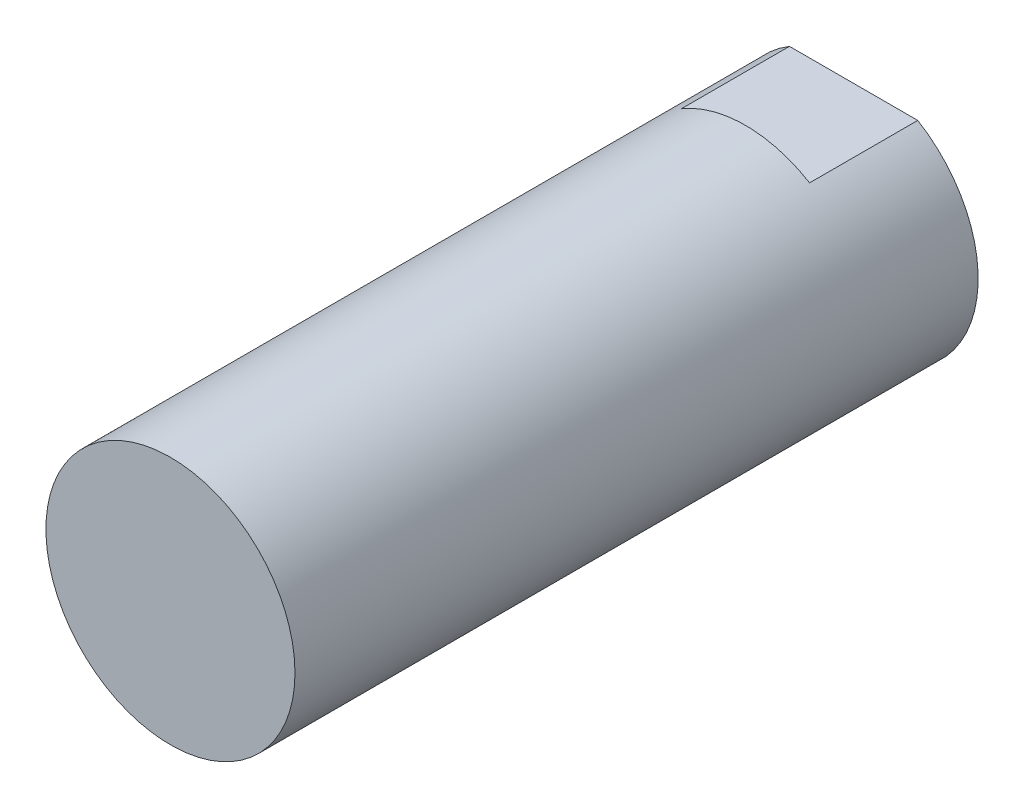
ISO-10303-21;
HEADER;
FILE_DESCRIPTION(('STEP AP214'),'2;1');
FILE_NAME('part.step','',(''),(''),'','','');
FILE_SCHEMA(('AUTOMOTIVE_DESIGN { 1 0 10303 214 1 1 1 1 }'));
ENDSEC;
DATA;
#1=APPLICATION_CONTEXT('core data for automotive mechanical design processes');
#2=APPLICATION_PROTOCOL_DEFINITION('international standard','automotive_design',2000,#1);
#3=PRODUCT_CONTEXT('',#1,'mechanical');
#4=PRODUCT('Part','Part','',(#3));
#5=PRODUCT_RELATED_PRODUCT_CATEGORY('part','',(#4));
#6=PRODUCT_DEFINITION_FORMATION('','',#4);
#7=PRODUCT_DEFINITION_CONTEXT('part definition',#1,'design');
#8=PRODUCT_DEFINITION('design','',#6,#7);
#9=PRODUCT_DEFINITION_SHAPE('','',#8);
#10=(LENGTH_UNIT() NAMED_UNIT(*) SI_UNIT(.MILLI.,.METRE.));
#11=(NAMED_UNIT(*) PLANE_ANGLE_UNIT() SI_UNIT($,.RADIAN.));
#12=(NAMED_UNIT(*) SI_UNIT($,.STERADIAN.) SOLID_ANGLE_UNIT());
#13=UNCERTAINTY_MEASURE_WITH_UNIT(LENGTH_MEASURE(1.E-05),#10,'distance_accuracy_value','');
#14=(GEOMETRIC_REPRESENTATION_CONTEXT(3) GLOBAL_UNCERTAINTY_ASSIGNED_CONTEXT((#13)) GLOBAL_UNIT_ASSIGNED_CONTEXT((#10,
#11,#12)) REPRESENTATION_CONTEXT('',''));
#15=CARTESIAN_POINT('',(0.,0.,0.));
#16=DIRECTION('',(0.,0.,1.));
#17=DIRECTION('',(1.,0.,0.));
#18=AXIS2_PLACEMENT_3D('',#15,#16,#17);
#19=CARTESIAN_POINT('',(0.,0.,22.86));
#20=DIRECTION('',(0.,0.,-1.));
#21=DIRECTION('',(-1.00000000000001,0.,0.));
#22=AXIS2_PLACEMENT_3D('',#19,#20,#21);
#23=CYLINDRICAL_SURFACE('',#22,11.1125);
#24=DIRECTION('',(0.,0.,-1.));
#25=VECTOR('',#24,1.);
#26=CARTESIAN_POINT('',(5.72381264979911,9.52499999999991,22.8599999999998));
#27=LINE('',#26,#25);
#28=CARTESIAN_POINT('',(5.72381264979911,9.52499999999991,9.65199999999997));
#29=VERTEX_POINT('',#28);
#30=CARTESIAN_POINT('',(5.72381264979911,9.52499999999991,-2.22044604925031E-13));
#31=VERTEX_POINT('',#30);
#32=EDGE_CURVE('E57',#29,#31,#27,.T.);
#33=ORIENTED_EDGE('',*,*,#32,.F.);
#34=CARTESIAN_POINT('',(0.,0.,9.65199999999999));
#35=DIRECTION('',(0.,0.,-1.));
#36=DIRECTION('',(-1.00000000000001,0.,0.));
#37=AXIS2_PLACEMENT_3D('',#34,#35,#36);
#38=CIRCLE('',#37,11.1125);
#39=CARTESIAN_POINT('',(-5.72381264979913,9.52500000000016,9.65199999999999));
#40=VERTEX_POINT('',#39);
#41=EDGE_CURVE('E12',#40,#29,#38,.T.);
#42=ORIENTED_EDGE('',*,*,#41,.F.);
#43=DIRECTION('',(0.,0.,-1.));
#44=VECTOR('',#43,1.);
#45=CARTESIAN_POINT('',(-5.7238126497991,9.52500000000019,22.86));
#46=LINE('',#45,#44);
#47=CARTESIAN_POINT('',(-5.72381264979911,9.52500000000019,0.));
#48=VERTEX_POINT('',#47);
#49=EDGE_CURVE('E113',#48,#40,#46,.F.);
#50=ORIENTED_EDGE('',*,*,#49,.F.);
#51=CARTESIAN_POINT('',(0.,0.,0.));
#52=DIRECTION('',(0.,0.,1.));
#53=DIRECTION('',(1.00000000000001,0.,0.));
#54=AXIS2_PLACEMENT_3D('',#51,#52,#53);
#55=CIRCLE('',#54,11.1125);
#56=CARTESIAN_POINT('',(-5.72381264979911,-9.52500000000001,0.));
#57=VERTEX_POINT('',#56);
#58=EDGE_CURVE('E93',#48,#57,#55,.T.);
#59=ORIENTED_EDGE('',*,*,#58,.T.);
#60=DIRECTION('',(0.,0.,-1.));
#61=VECTOR('',#60,1.);
#62=CARTESIAN_POINT('',(-5.7238126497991,-9.52500000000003,22.86));
#63=LINE('',#62,#61);
#64=CARTESIAN_POINT('',(-5.72381264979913,-9.52499999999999,9.65199999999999));
#65=VERTEX_POINT('',#64);
#66=EDGE_CURVE('E49',#65,#57,#63,.T.);
#67=ORIENTED_EDGE('',*,*,#66,.F.);
#68=CARTESIAN_POINT('',(5.7238126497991,-9.52499999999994,9.65199999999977));
#69=VERTEX_POINT('',#68);
#70=EDGE_CURVE('E38',#69,#65,#38,.T.);
#71=ORIENTED_EDGE('',*,*,#70,.F.);
#72=DIRECTION('',(0.,0.,-1.));
#73=VECTOR('',#72,1.);
#74=CARTESIAN_POINT('',(5.72381264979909,-9.52499999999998,22.8599999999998));
#75=LINE('',#74,#73);
#76=CARTESIAN_POINT('',(5.72381264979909,-9.52499999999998,-2.22044604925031E-13));
#77=VERTEX_POINT('',#76);
#78=EDGE_CURVE('E76',#77,#69,#75,.F.);
#79=ORIENTED_EDGE('',*,*,#78,.F.);
#80=EDGE_CURVE('E89',#77,#31,#55,.T.);
#81=ORIENTED_EDGE('',*,*,#80,.T.);
#82=EDGE_LOOP('',(#33,#42,#50,#59,#67,#71,#79,#81));
#83=FACE_BOUND('',#82,.T.);
#84=CARTESIAN_POINT('',(0.,0.,60.96));
#85=DIRECTION('',(0.,0.,1.));
#86=DIRECTION('',(1.00000000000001,0.,0.));
#87=AXIS2_PLACEMENT_3D('',#84,#85,#86);
#88=CIRCLE('',#87,11.1125);
#89=CARTESIAN_POINT('',(11.1125000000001,0.,60.96));
#90=VERTEX_POINT('',#89);
#91=EDGE_CURVE('E162',#90,#90,#88,.T.);
#92=ORIENTED_EDGE('',*,*,#91,.F.);
#93=EDGE_LOOP('',(#92));
#94=FACE_BOUND('',#93,.T.);
#95=ADVANCED_FACE('F35',(#83,#94),#23,.T.);
#96=CARTESIAN_POINT('',(0.,0.,0.));
#97=DIRECTION('',(0.,0.,1.));
#98=DIRECTION('',(1.00000000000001,0.,0.));
#99=AXIS2_PLACEMENT_3D('',#96,#97,#98);
#100=PLANE('',#99);
#101=CARTESIAN_POINT('',(0.,0.,0.));
#102=DIRECTION('',(0.,0.,-1.));
#103=DIRECTION('',(-1.00000000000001,0.,0.));
#104=AXIS2_PLACEMENT_3D('',#101,#102,#103);
#105=CIRCLE('',#104,3.96875);
#106=CARTESIAN_POINT('',(-3.96875000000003,0.,0.));
#107=VERTEX_POINT('',#106);
#108=EDGE_CURVE('E104',#107,#107,#105,.T.);
#109=ORIENTED_EDGE('',*,*,#108,.F.);
#110=EDGE_LOOP('',(#109));
#111=FACE_BOUND('',#110,.T.);
#112=DIRECTION('',(-1.00000000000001,0.,0.));
#113=VECTOR('',#112,1.);
#114=CARTESIAN_POINT('',(0.,9.52500000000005,-2.22044604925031E-13));
#115=LINE('',#114,#113);
#116=EDGE_CURVE('E82',#31,#48,#115,.T.);
#117=ORIENTED_EDGE('',*,*,#116,.F.);
#118=ORIENTED_EDGE('',*,*,#80,.F.);
#119=DIRECTION('',(1.00000000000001,0.,0.));
#120=VECTOR('',#119,1.);
#121=CARTESIAN_POINT('',(0.,-9.52500000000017,0.));
#122=LINE('',#121,#120);
#123=EDGE_CURVE('E73',#57,#77,#122,.T.);
#124=ORIENTED_EDGE('',*,*,#123,.F.);
#125=ORIENTED_EDGE('',*,*,#58,.F.);
#126=EDGE_LOOP('',(#117,#118,#124,#125));
#127=FACE_BOUND('',#126,.T.);
#128=ADVANCED_FACE('F92',(#111,#127),#100,.F.);
#129=CARTESIAN_POINT('',(0.,0.,11.938));
#130=DIRECTION('',(0.,0.,1.));
#131=DIRECTION('',(1.00000000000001,0.,0.));
#132=AXIS2_PLACEMENT_3D('',#129,#130,#131);
#133=CYLINDRICAL_SURFACE('',#132,5.55625);
#134=CARTESIAN_POINT('',(0.,0.,21.10023637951));
#135=DIRECTION('',(0.,0.,1.));
#136=DIRECTION('',(1.00000000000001,0.,0.));
#137=AXIS2_PLACEMENT_3D('',#134,#135,#136);
#138=CIRCLE('',#137,5.55625);
#139=CARTESIAN_POINT('',(5.55625000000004,0.,21.10023637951));
#140=VERTEX_POINT('',#139);
#141=EDGE_CURVE('E96',#140,#140,#138,.T.);
#142=ORIENTED_EDGE('',*,*,#141,.T.);
#143=EDGE_LOOP('',(#142));
#144=FACE_BOUND('',#143,.T.);
#145=CARTESIAN_POINT('',(0.,0.,11.938));
#146=DIRECTION('',(0.,0.,1.));
#147=DIRECTION('',(1.00000000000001,0.,0.));
#148=AXIS2_PLACEMENT_3D('',#145,#146,#147);
#149=CIRCLE('',#148,5.55625);
#150=CARTESIAN_POINT('',(5.55625000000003,0.,11.938));
#151=VERTEX_POINT('',#150);
#152=EDGE_CURVE('E94',#151,#151,#149,.T.);
#153=ORIENTED_EDGE('',*,*,#152,.F.);
#154=EDGE_LOOP('',(#153));
#155=FACE_BOUND('',#154,.T.);
#156=ADVANCED_FACE('F123',(#144,#155),#133,.F.);
#157=CARTESIAN_POINT('',(0.,0.,11.938));
#158=DIRECTION('',(0.,0.,1.));
#159=DIRECTION('',(1.00000000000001,0.,0.));
#160=AXIS2_PLACEMENT_3D('',#157,#158,#159);
#161=PLANE('',#160);
#162=CARTESIAN_POINT('',(0.,0.,11.938));
#163=DIRECTION('',(0.,0.,1.));
#164=DIRECTION('',(1.00000000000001,0.,0.));
#165=AXIS2_PLACEMENT_3D('',#162,#163,#164);
#166=CIRCLE('',#165,3.96875);
#167=CARTESIAN_POINT('',(3.96875000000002,0.,11.938));
#168=VERTEX_POINT('',#167);
#169=EDGE_CURVE('E98',#168,#168,#166,.T.);
#170=ORIENTED_EDGE('',*,*,#169,.F.);
#171=EDGE_LOOP('',(#170));
#172=FACE_BOUND('',#171,.T.);
#173=ORIENTED_EDGE('',*,*,#152,.T.);
#174=EDGE_LOOP('',(#173));
#175=FACE_BOUND('',#174,.T.);
#176=ADVANCED_FACE('F128',(#172,#175),#161,.T.);
#177=CARTESIAN_POINT('',(0.,0.,22.86));
#178=DIRECTION('',(0.,0.,-1.));
#179=DIRECTION('',(-1.00000000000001,0.,0.));
#180=AXIS2_PLACEMENT_3D('',#177,#178,#179);
#181=CYLINDRICAL_SURFACE('',#180,3.96875);
#182=ORIENTED_EDGE('',*,*,#169,.T.);
#183=EDGE_LOOP('',(#182));
#184=FACE_BOUND('',#183,.T.);
#185=ORIENTED_EDGE('',*,*,#108,.T.);
#186=EDGE_LOOP('',(#185));
#187=FACE_BOUND('',#186,.T.);
#188=ADVANCED_FACE('F120',(#184,#187),#181,.F.);
#189=CARTESIAN_POINT('',(0.,0.,21.10023637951));
#190=DIRECTION('',(0.,0.,1.));
#191=DIRECTION('',(1.00000000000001,0.,0.));
#192=AXIS2_PLACEMENT_3D('',#189,#190,#191);
#193=CONICAL_SURFACE('',#192,5.55625,0.523598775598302);
#194=CARTESIAN_POINT('',(0.,0.,22.86));
#195=DIRECTION('',(0.,0.,1.));
#196=DIRECTION('',(1.00000000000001,0.,0.));
#197=AXIS2_PLACEMENT_3D('',#194,#195,#196);
#198=CIRCLE('',#197,6.57225000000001);
#199=CARTESIAN_POINT('',(6.57225000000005,0.,22.86));
#200=VERTEX_POINT('',#199);
#201=EDGE_CURVE('E83',#200,#200,#198,.F.);
#202=ORIENTED_EDGE('',*,*,#201,.F.);
#203=EDGE_LOOP('',(#202));
#204=FACE_BOUND('',#203,.T.);
#205=ORIENTED_EDGE('',*,*,#141,.F.);
#206=EDGE_LOOP('',(#205));
#207=FACE_BOUND('',#206,.T.);
#208=ADVANCED_FACE('F137',(#204,#207),#193,.F.);
#209=CARTESIAN_POINT('',(-13.4236822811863,-9.52499999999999,9.65199999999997));
#210=DIRECTION('',(0.,-1.00000000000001,0.));
#211=DIRECTION('',(1.00000000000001,0.,0.));
#212=AXIS2_PLACEMENT_3D('',#209,#210,#211);
#213=PLANE('',#212);
#214=ORIENTED_EDGE('',*,*,#66,.T.);
#215=ORIENTED_EDGE('',*,*,#123,.T.);
#216=ORIENTED_EDGE('',*,*,#78,.T.);
#217=DIRECTION('',(-1.00000000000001,0.,0.));
#218=VECTOR('',#217,1.);
#219=CARTESIAN_POINT('',(-13.4236822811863,-9.52499999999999,9.65199999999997));
#220=LINE('',#219,#218);
#221=EDGE_CURVE('E90',#69,#65,#220,.T.);
#222=ORIENTED_EDGE('',*,*,#221,.T.);
#223=EDGE_LOOP('',(#214,#215,#216,#222));
#224=FACE_BOUND('',#223,.T.);
#225=ADVANCED_FACE('F75',(#224),#213,.T.);
#226=CARTESIAN_POINT('',(-0.572031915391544,0.,9.65199999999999));
#227=DIRECTION('',(0.,0.,-1.));
#228=DIRECTION('',(-1.00000000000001,0.,0.));
#229=AXIS2_PLACEMENT_3D('',#226,#227,#228);
#230=PLANE('',#229);
#231=ORIENTED_EDGE('',*,*,#70,.T.);
#232=ORIENTED_EDGE('',*,*,#221,.F.);
#233=EDGE_LOOP('',(#231,#232));
#234=FACE_BOUND('',#233,.T.);
#235=ADVANCED_FACE('F110',(#234),#230,.T.);
#236=ORIENTED_EDGE('',*,*,#41,.T.);
#237=DIRECTION('',(1.00000000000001,0.,0.));
#238=VECTOR('',#237,1.);
#239=CARTESIAN_POINT('',(12.2796184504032,9.52500000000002,9.65199999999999));
#240=LINE('',#239,#238);
#241=EDGE_CURVE('E111',#40,#29,#240,.T.);
#242=ORIENTED_EDGE('',*,*,#241,.F.);
#243=EDGE_LOOP('',(#236,#242));
#244=FACE_BOUND('',#243,.T.);
#245=ADVANCED_FACE('F142',(#244),#230,.T.);
#246=CARTESIAN_POINT('',(0.,9.52500000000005,9.65199999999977));
#247=DIRECTION('',(0.,1.00000000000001,0.));
#248=DIRECTION('',(0.,0.,1.));
#249=AXIS2_PLACEMENT_3D('',#246,#247,#248);
#250=PLANE('',#249);
#251=ORIENTED_EDGE('',*,*,#32,.T.);
#252=ORIENTED_EDGE('',*,*,#116,.T.);
#253=ORIENTED_EDGE('',*,*,#49,.T.);
#254=ORIENTED_EDGE('',*,*,#241,.T.);
#255=EDGE_LOOP('',(#251,#252,#253,#254));
#256=FACE_BOUND('',#255,.T.);
#257=ADVANCED_FACE('F145',(#256),#250,.T.);
#258=CARTESIAN_POINT('',(0.,0.,22.86));
#259=DIRECTION('',(0.,0.,1.));
#260=DIRECTION('',(1.00000000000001,0.,0.));
#261=AXIS2_PLACEMENT_3D('',#258,#259,#260);
#262=PLANE('',#261);
#263=ORIENTED_EDGE('',*,*,#201,.T.);
#264=EDGE_LOOP('',(#263));
#265=FACE_BOUND('',#264,.T.);
#266=ADVANCED_FACE('F151',(#265),#262,.F.);
#267=CARTESIAN_POINT('',(0.,0.,60.96));
#268=DIRECTION('',(0.,0.,1.));
#269=DIRECTION('',(1.00000000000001,0.,0.));
#270=AXIS2_PLACEMENT_3D('',#267,#268,#269);
#271=PLANE('',#270);
#272=ORIENTED_EDGE('',*,*,#91,.T.);
#273=EDGE_LOOP('',(#272));
#274=FACE_BOUND('',#273,.T.);
#275=ADVANCED_FACE('F154',(#274),#271,.T.);
#276=CLOSED_SHELL('',(#95,#128,#156,#176,#188,#208,#225,#235,#245,#257,#266,#275));
#277=MANIFOLD_SOLID_BREP('B2',#276);
#278=ADVANCED_BREP_SHAPE_REPRESENTATION('',(#18,#277),#14);
#279=SHAPE_DEFINITION_REPRESENTATION(#9,#278);
ENDSEC;
END-ISO-10303-21;
